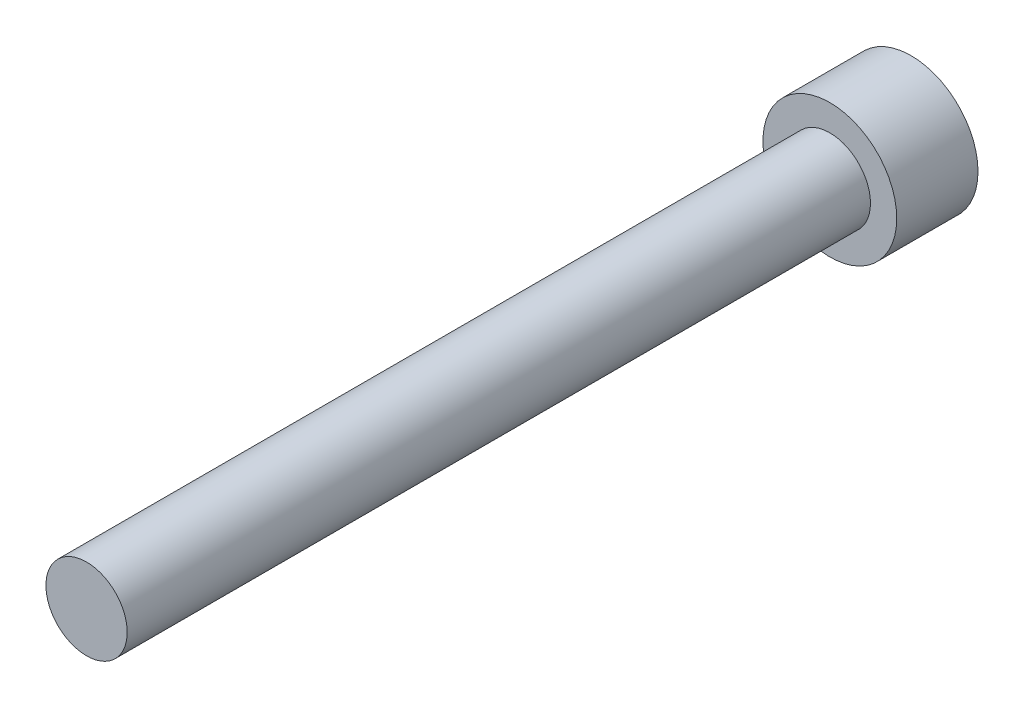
from build123d import *

# Parameters (mm, degrees)
HEX_2_DEPTH = 2.794


with BuildPart() as part:
    # Sketch6 → Revolve1 (revolve)
    with BuildSketch(Plane(origin=(0, 0, 0), x_dir=(0, 0, -1), z_dir=(1, 0, 0)), mode=Mode.PRIVATE) as revolve1_sk:
        Polygon((-38.1, 0), (-38.1, -2.0828), (0, -2.0828), (0, -3.429), (4.1656, -3.429), (4.1656, 0), align=None)
    revolve(revolve1_sk.sketch.rotate(Axis((0, 0, 38.1), (0, 0, -1)), 270), axis=Axis((0, 0, 38.1), (0, 0, -1)))

    # Sketch7 → HEX 2 (cut)
    with BuildSketch(Plane(origin=(0, 0, -4.1656), x_dir=(-1, 0, 0), z_dir=(0, 0, -1))):
        Polygon((-1.778, 1.026528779), (-1.778, -1.026528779), (0, -2.053057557), (1.778, -1.026528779), (1.778, 1.026528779), (0, 2.053057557), align=None)
    extrude(amount=-HEX_2_DEPTH, mode=Mode.SUBTRACT)


solid = part.part
